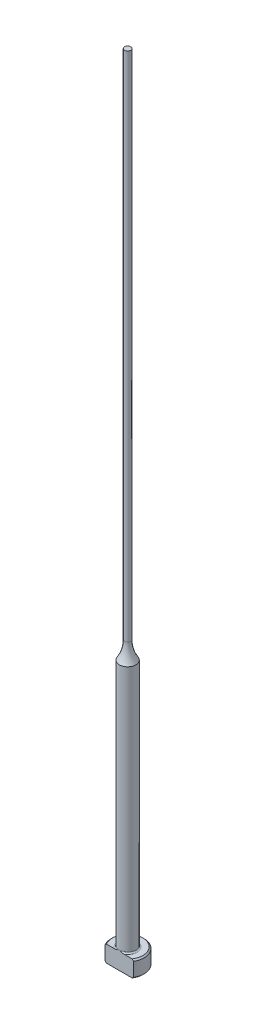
from build123d import *

# Parameters (mm, degrees)
CHAMFER1_SIZE = 0.254
FILLET1_R     = 0.254
KEY_DEPTH     = 153.466131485


with BuildPart() as part:
    # Sketch1 → Revolve1 (revolve)
    with BuildSketch(Plane.XY, mode=Mode.PRIVATE) as revolve1_sk:
        with BuildLine():
            Line((0, 0), (-3.175, 0))
            Line((-3.175, 0), (-3.175, 3.175))
            Line((-3.175, 3.175), (-1.5875, 3.175))
            Line((-1.5875, 3.175), (-1.5875, 50.8))
            ThreePointArc((-1.5875, 50.8), (-0.847698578, 52.434042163), (-0.59436, 54.209772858))
            Line((-0.59436, 54.209772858), (-0.59436, 152.4))
            Line((-0.59436, 152.4), (0, 152.4))
            Line((0, 152.4), (0, 0))
        make_face()
    revolve(revolve1_sk.sketch.rotate(Axis((0, 259.958771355, 0), (0, -1, 0)), 270), axis=Axis((0, 259.958771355, 0), (0, -1, 0)))

    # Chamfer1
    chamfer1_edges = [part.edges().sort_by_distance(p)[0] for p in [
        (0, 0, -3.175),
        (0, 3.175, -3.175),
    ]]
    chamfer(chamfer1_edges, length=CHAMFER1_SIZE)

    # Fillet1
    fillet1_edges = [part.edges().sort_by_distance(p)[0] for p in [
        (0, 3.175, -1.5875),
    ]]
    fillet(fillet1_edges, radius=FILLET1_R)

    # Sketch2 → KEY (cut, through all)
    with BuildSketch(Plane.XZ):
        with BuildLine():
            Line((-2.749630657, 1.5875), (2.749630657, 1.5875))
            ThreePointArc((2.749630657, 1.5875), (0, 3.175), (-2.749630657, 1.5875))
        make_face()
    extrude(amount=-KEY_DEPTH, mode=Mode.SUBTRACT)


solid = part.part
